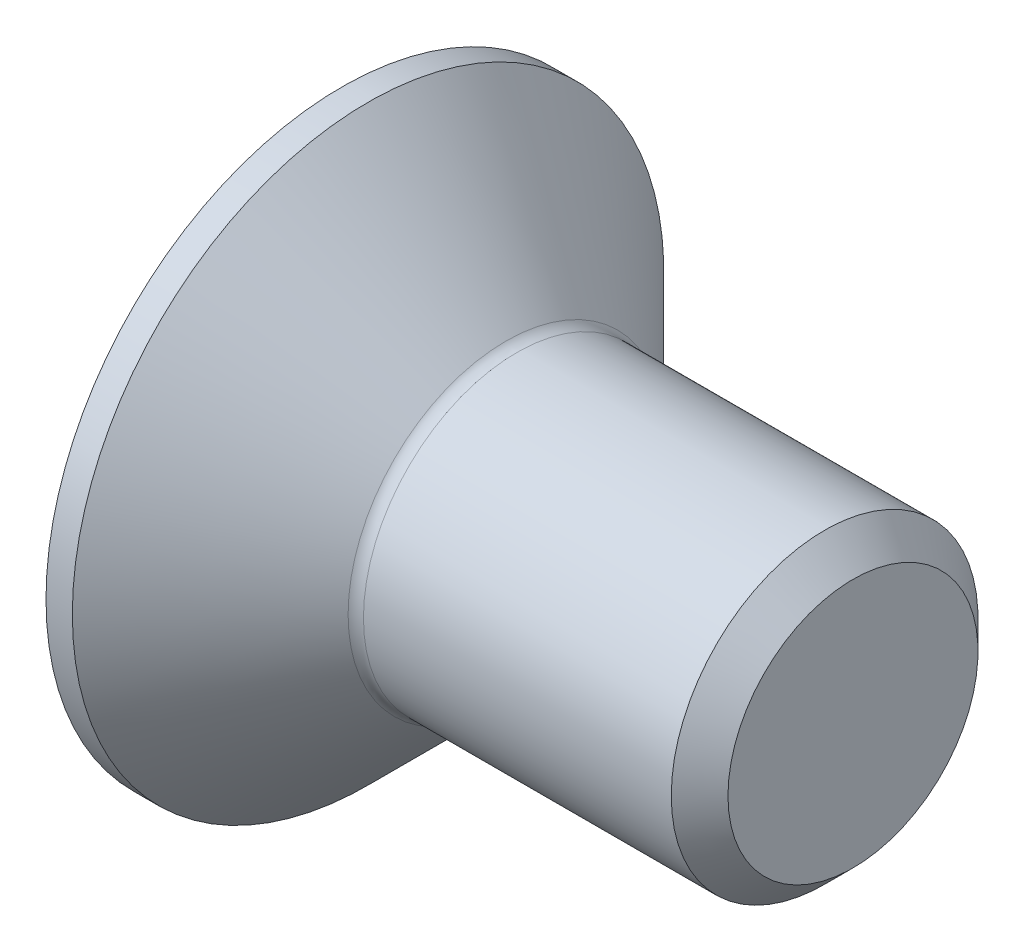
ISO-10303-21;
HEADER;
FILE_DESCRIPTION(('STEP AP214'),'2;1');
FILE_NAME('part.step','',(''),(''),'','','');
FILE_SCHEMA(('AUTOMOTIVE_DESIGN { 1 0 10303 214 1 1 1 1 }'));
ENDSEC;
DATA;
#1=APPLICATION_CONTEXT('core data for automotive mechanical design processes');
#2=APPLICATION_PROTOCOL_DEFINITION('international standard','automotive_design',2000,#1);
#3=PRODUCT_CONTEXT('',#1,'mechanical');
#4=PRODUCT('Part','Part','',(#3));
#5=PRODUCT_RELATED_PRODUCT_CATEGORY('part','',(#4));
#6=PRODUCT_DEFINITION_FORMATION('','',#4);
#7=PRODUCT_DEFINITION_CONTEXT('part definition',#1,'design');
#8=PRODUCT_DEFINITION('design','',#6,#7);
#9=PRODUCT_DEFINITION_SHAPE('','',#8);
#10=(LENGTH_UNIT() NAMED_UNIT(*) SI_UNIT(.MILLI.,.METRE.));
#11=(NAMED_UNIT(*) PLANE_ANGLE_UNIT() SI_UNIT($,.RADIAN.));
#12=(NAMED_UNIT(*) SI_UNIT($,.STERADIAN.) SOLID_ANGLE_UNIT());
#13=UNCERTAINTY_MEASURE_WITH_UNIT(LENGTH_MEASURE(1.E-05),#10,'distance_accuracy_value','');
#14=(GEOMETRIC_REPRESENTATION_CONTEXT(3) GLOBAL_UNCERTAINTY_ASSIGNED_CONTEXT((#13)) GLOBAL_UNIT_ASSIGNED_CONTEXT((#10,
#11,#12)) REPRESENTATION_CONTEXT('',''));
#15=CARTESIAN_POINT('',(0.,0.,0.));
#16=DIRECTION('',(0.,0.,1.));
#17=DIRECTION('',(1.,0.,0.));
#18=AXIS2_PLACEMENT_3D('',#15,#16,#17);
#19=CARTESIAN_POINT('',(0.,0.,0.));
#20=DIRECTION('',(-1.,0.,0.));
#21=DIRECTION('',(0.,0.,1.));
#22=AXIS2_PLACEMENT_3D('',#19,#20,#21);
#23=PLANE('',#22);
#24=CARTESIAN_POINT('',(0.,0.,0.));
#25=DIRECTION('',(-1.,0.,0.));
#26=DIRECTION('',(0.,0.,1.));
#27=AXIS2_PLACEMENT_3D('',#24,#25,#26);
#28=CIRCLE('',#27,5.785);
#29=CARTESIAN_POINT('',(0.,0.,5.785));
#30=VERTEX_POINT('',#29);
#31=EDGE_CURVE('E177',#30,#30,#28,.T.);
#32=ORIENTED_EDGE('',*,*,#31,.T.);
#33=EDGE_LOOP('',(#32));
#34=FACE_BOUND('',#33,.T.);
#35=DIRECTION('',(0.,-0.500000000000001,-0.866025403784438));
#36=VECTOR('',#35,1.);
#37=CARTESIAN_POINT('',(0.,-1.16047404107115,2.01));
#38=LINE('',#37,#36);
#39=CARTESIAN_POINT('',(0.,-1.16047404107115,2.01));
#40=VERTEX_POINT('',#39);
#41=CARTESIAN_POINT('',(0.,-2.3209480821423,0.));
#42=VERTEX_POINT('',#41);
#43=EDGE_CURVE('E131',#40,#42,#38,.T.);
#44=ORIENTED_EDGE('',*,*,#43,.T.);
#45=DIRECTION('',(0.,0.5,-0.866025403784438));
#46=VECTOR('',#45,1.);
#47=CARTESIAN_POINT('',(0.,-2.3209480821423,0.));
#48=LINE('',#47,#46);
#49=CARTESIAN_POINT('',(0.,-1.16047404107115,-2.01));
#50=VERTEX_POINT('',#49);
#51=EDGE_CURVE('E60',#42,#50,#48,.T.);
#52=ORIENTED_EDGE('',*,*,#51,.T.);
#53=DIRECTION('',(0.,1.,0.));
#54=VECTOR('',#53,1.);
#55=CARTESIAN_POINT('',(0.,-1.16047404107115,-2.01));
#56=LINE('',#55,#54);
#57=CARTESIAN_POINT('',(0.,1.16047404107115,-2.01));
#58=VERTEX_POINT('',#57);
#59=EDGE_CURVE('E147',#50,#58,#56,.T.);
#60=ORIENTED_EDGE('',*,*,#59,.T.);
#61=DIRECTION('',(0.,0.5,0.866025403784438));
#62=VECTOR('',#61,1.);
#63=CARTESIAN_POINT('',(0.,1.16047404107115,-2.01));
#64=LINE('',#63,#62);
#65=CARTESIAN_POINT('',(0.,2.3209480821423,0.));
#66=VERTEX_POINT('',#65);
#67=EDGE_CURVE('E305',#58,#66,#64,.T.);
#68=ORIENTED_EDGE('',*,*,#67,.T.);
#69=DIRECTION('',(0.,-0.5,0.866025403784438));
#70=VECTOR('',#69,1.);
#71=CARTESIAN_POINT('',(0.,2.3209480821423,0.));
#72=LINE('',#71,#70);
#73=CARTESIAN_POINT('',(0.,1.16047404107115,2.01));
#74=VERTEX_POINT('',#73);
#75=EDGE_CURVE('E309',#66,#74,#72,.T.);
#76=ORIENTED_EDGE('',*,*,#75,.T.);
#77=DIRECTION('',(0.,-1.,0.));
#78=VECTOR('',#77,1.);
#79=CARTESIAN_POINT('',(0.,1.16047404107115,2.01));
#80=LINE('',#79,#78);
#81=EDGE_CURVE('E313',#74,#40,#80,.T.);
#82=ORIENTED_EDGE('',*,*,#81,.T.);
#83=EDGE_LOOP('',(#44,#52,#60,#68,#76,#82));
#84=FACE_BOUND('',#83,.T.);
#85=ADVANCED_FACE('F44',(#34,#84),#23,.T.);
#86=CARTESIAN_POINT('',(0.,0.,0.));
#87=DIRECTION('',(-1.,0.,0.));
#88=DIRECTION('',(0.,0.,1.));
#89=AXIS2_PLACEMENT_3D('',#86,#87,#88);
#90=CYLINDRICAL_SURFACE('',#89,5.785);
#91=CARTESIAN_POINT('',(0.515000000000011,0.,0.));
#92=DIRECTION('',(-1.,0.,0.));
#93=DIRECTION('',(0.,0.,1.));
#94=AXIS2_PLACEMENT_3D('',#91,#92,#93);
#95=CIRCLE('',#94,5.785);
#96=CARTESIAN_POINT('',(0.515000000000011,0.,5.785));
#97=VERTEX_POINT('',#96);
#98=EDGE_CURVE('E173',#97,#97,#95,.T.);
#99=ORIENTED_EDGE('',*,*,#98,.T.);
#100=EDGE_LOOP('',(#99));
#101=FACE_BOUND('',#100,.T.);
#102=ORIENTED_EDGE('',*,*,#31,.F.);
#103=EDGE_LOOP('',(#102));
#104=FACE_BOUND('',#103,.T.);
#105=ADVANCED_FACE('F200',(#101,#104),#90,.T.);
#106=CARTESIAN_POINT('',(0.515000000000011,0.,0.));
#107=DIRECTION('',(-1.,0.,0.));
#108=DIRECTION('',(0.,0.,1.));
#109=AXIS2_PLACEMENT_3D('',#106,#107,#108);
#110=CONICAL_SURFACE('',#109,5.785,0.78539816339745);
#111=CARTESIAN_POINT('',(3.21213203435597,0.,0.));
#112=DIRECTION('',(-1.,0.,0.));
#113=DIRECTION('',(0.,0.,1.));
#114=AXIS2_PLACEMENT_3D('',#111,#112,#113);
#115=CIRCLE('',#114,3.08786796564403);
#116=CARTESIAN_POINT('',(3.21213203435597,0.,3.08786796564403));
#117=VERTEX_POINT('',#116);
#118=EDGE_CURVE('E53',#117,#117,#115,.T.);
#119=ORIENTED_EDGE('',*,*,#118,.T.);
#120=EDGE_LOOP('',(#119));
#121=FACE_BOUND('',#120,.T.);
#122=ORIENTED_EDGE('',*,*,#98,.F.);
#123=EDGE_LOOP('',(#122));
#124=FACE_BOUND('',#123,.T.);
#125=ADVANCED_FACE('F184',(#121,#124),#110,.T.);
#126=CARTESIAN_POINT('',(0.,0.,0.));
#127=DIRECTION('',(-1.,0.,0.));
#128=DIRECTION('',(0.,0.,1.));
#129=AXIS2_PLACEMENT_3D('',#126,#127,#128);
#130=CYLINDRICAL_SURFACE('',#129,2.99999999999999);
#131=CARTESIAN_POINT('',(3.42426406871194,0.,0.));
#132=DIRECTION('',(-1.,0.,0.));
#133=DIRECTION('',(0.,0.,1.));
#134=AXIS2_PLACEMENT_3D('',#131,#132,#133);
#135=CIRCLE('',#134,2.99999999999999);
#136=CARTESIAN_POINT('',(3.42426406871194,0.,2.99999999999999));
#137=VERTEX_POINT('',#136);
#138=EDGE_CURVE('E11',#137,#137,#135,.F.);
#139=ORIENTED_EDGE('',*,*,#138,.T.);
#140=EDGE_LOOP('',(#139));
#141=FACE_BOUND('',#140,.T.);
#142=CARTESIAN_POINT('',(9.44549999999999,0.,0.));
#143=DIRECTION('',(-1.,0.,0.));
#144=DIRECTION('',(0.,0.,1.));
#145=AXIS2_PLACEMENT_3D('',#142,#143,#144);
#146=CIRCLE('',#145,2.99999999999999);
#147=CARTESIAN_POINT('',(9.44549999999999,0.,2.99999999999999));
#148=VERTEX_POINT('',#147);
#149=EDGE_CURVE('E169',#148,#148,#146,.T.);
#150=ORIENTED_EDGE('',*,*,#149,.T.);
#151=EDGE_LOOP('',(#150));
#152=FACE_BOUND('',#151,.T.);
#153=ADVANCED_FACE('F211',(#141,#152),#130,.T.);
#154=CARTESIAN_POINT('',(10.,0.,0.));
#155=DIRECTION('',(-1.,0.,0.));
#156=DIRECTION('',(0.,0.,1.));
#157=AXIS2_PLACEMENT_3D('',#154,#155,#156);
#158=CONICAL_SURFACE('',#157,2.4455,0.785398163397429);
#159=ORIENTED_EDGE('',*,*,#149,.F.);
#160=EDGE_LOOP('',(#159));
#161=FACE_BOUND('',#160,.T.);
#162=CARTESIAN_POINT('',(10.,0.,0.));
#163=DIRECTION('',(-1.,0.,0.));
#164=DIRECTION('',(0.,0.,1.));
#165=AXIS2_PLACEMENT_3D('',#162,#163,#164);
#166=CIRCLE('',#165,2.4455);
#167=CARTESIAN_POINT('',(10.,0.,2.4455));
#168=VERTEX_POINT('',#167);
#169=EDGE_CURVE('E164',#168,#168,#166,.T.);
#170=ORIENTED_EDGE('',*,*,#169,.T.);
#171=EDGE_LOOP('',(#170));
#172=FACE_BOUND('',#171,.T.);
#173=ADVANCED_FACE('F195',(#161,#172),#158,.T.);
#174=CARTESIAN_POINT('',(10.,2.4455,0.));
#175=DIRECTION('',(1.,0.,0.));
#176=DIRECTION('',(0.,0.,-1.));
#177=AXIS2_PLACEMENT_3D('',#174,#175,#176);
#178=PLANE('',#177);
#179=ORIENTED_EDGE('',*,*,#169,.F.);
#180=EDGE_LOOP('',(#179));
#181=FACE_BOUND('',#180,.T.);
#182=ADVANCED_FACE('F188',(#181),#178,.T.);
#183=CARTESIAN_POINT('',(3.42426406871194,0.,0.));
#184=DIRECTION('',(-1.,0.,0.));
#185=DIRECTION('',(0.,0.,1.));
#186=AXIS2_PLACEMENT_3D('',#183,#184,#185);
#187=TOROIDAL_SURFACE('',#186,3.29999999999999,0.3);
#188=ORIENTED_EDGE('',*,*,#138,.F.);
#189=EDGE_LOOP('',(#188));
#190=FACE_BOUND('',#189,.T.);
#191=ORIENTED_EDGE('',*,*,#118,.F.);
#192=EDGE_LOOP('',(#191));
#193=FACE_BOUND('',#192,.T.);
#194=ADVANCED_FACE('F46',(#190,#193),#187,.F.);
#195=CARTESIAN_POINT('',(2.5,-2.3209480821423,0.));
#196=DIRECTION('',(0.,0.866025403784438,0.5));
#197=DIRECTION('',(0.,-0.5,0.866025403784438));
#198=AXIS2_PLACEMENT_3D('',#195,#196,#197);
#199=PLANE('',#198);
#200=ORIENTED_EDGE('',*,*,#51,.F.);
#201=DIRECTION('',(-1.,0.,0.));
#202=VECTOR('',#201,1.);
#203=CARTESIAN_POINT('',(2.5,-2.3209480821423,0.));
#204=LINE('',#203,#202);
#205=CARTESIAN_POINT('',(2.5,-2.3209480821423,0.));
#206=VERTEX_POINT('',#205);
#207=EDGE_CURVE('E300',#206,#42,#204,.T.);
#208=ORIENTED_EDGE('',*,*,#207,.F.);
#209=DIRECTION('',(0.,0.5,-0.866025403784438));
#210=VECTOR('',#209,1.);
#211=CARTESIAN_POINT('',(2.5,-2.3209480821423,0.));
#212=LINE('',#211,#210);
#213=CARTESIAN_POINT('',(2.5,-1.74071106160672,-1.005));
#214=VERTEX_POINT('',#213);
#215=EDGE_CURVE('E127',#206,#214,#212,.T.);
#216=ORIENTED_EDGE('',*,*,#215,.T.);
#217=CARTESIAN_POINT('',(2.5,-1.16047404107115,-2.01));
#218=VERTEX_POINT('',#217);
#219=EDGE_CURVE('E121',#214,#218,#212,.T.);
#220=ORIENTED_EDGE('',*,*,#219,.T.);
#221=DIRECTION('',(-1.,0.,0.));
#222=VECTOR('',#221,1.);
#223=CARTESIAN_POINT('',(2.5,-1.16047404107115,-2.01));
#224=LINE('',#223,#222);
#225=EDGE_CURVE('E125',#218,#50,#224,.T.);
#226=ORIENTED_EDGE('',*,*,#225,.T.);
#227=EDGE_LOOP('',(#200,#208,#216,#220,#226));
#228=FACE_BOUND('',#227,.T.);
#229=ADVANCED_FACE('F123',(#228),#199,.T.);
#230=CARTESIAN_POINT('',(2.5,-1.16047404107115,-2.01));
#231=DIRECTION('',(0.,0.,1.));
#232=DIRECTION('',(1.,0.,0.));
#233=AXIS2_PLACEMENT_3D('',#230,#231,#232);
#234=PLANE('',#233);
#235=ORIENTED_EDGE('',*,*,#59,.F.);
#236=ORIENTED_EDGE('',*,*,#225,.F.);
#237=DIRECTION('',(0.,1.,0.));
#238=VECTOR('',#237,1.);
#239=CARTESIAN_POINT('',(2.5,-1.16047404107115,-2.01));
#240=LINE('',#239,#238);
#241=CARTESIAN_POINT('',(2.5,0.,-2.01));
#242=VERTEX_POINT('',#241);
#243=EDGE_CURVE('E134',#218,#242,#240,.T.);
#244=ORIENTED_EDGE('',*,*,#243,.T.);
#245=CARTESIAN_POINT('',(2.5,1.16047404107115,-2.01));
#246=VERTEX_POINT('',#245);
#247=EDGE_CURVE('E142',#242,#246,#240,.T.);
#248=ORIENTED_EDGE('',*,*,#247,.T.);
#249=DIRECTION('',(-1.,0.,0.));
#250=VECTOR('',#249,1.);
#251=CARTESIAN_POINT('',(2.5,1.16047404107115,-2.01));
#252=LINE('',#251,#250);
#253=EDGE_CURVE('E150',#246,#58,#252,.T.);
#254=ORIENTED_EDGE('',*,*,#253,.T.);
#255=EDGE_LOOP('',(#235,#236,#244,#248,#254));
#256=FACE_BOUND('',#255,.T.);
#257=ADVANCED_FACE('F144',(#256),#234,.T.);
#258=CARTESIAN_POINT('',(2.5,1.16047404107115,-2.01));
#259=DIRECTION('',(0.,-0.866025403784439,0.5));
#260=DIRECTION('',(0.,-0.5,-0.866025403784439));
#261=AXIS2_PLACEMENT_3D('',#258,#259,#260);
#262=PLANE('',#261);
#263=ORIENTED_EDGE('',*,*,#67,.F.);
#264=ORIENTED_EDGE('',*,*,#253,.F.);
#265=DIRECTION('',(0.,0.5,0.866025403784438));
#266=VECTOR('',#265,1.);
#267=CARTESIAN_POINT('',(2.5,1.16047404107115,-2.01));
#268=LINE('',#267,#266);
#269=CARTESIAN_POINT('',(2.5,1.74071106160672,-1.005));
#270=VERTEX_POINT('',#269);
#271=EDGE_CURVE('E288',#246,#270,#268,.T.);
#272=ORIENTED_EDGE('',*,*,#271,.T.);
#273=CARTESIAN_POINT('',(2.5,2.3209480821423,0.));
#274=VERTEX_POINT('',#273);
#275=EDGE_CURVE('E141',#270,#274,#268,.T.);
#276=ORIENTED_EDGE('',*,*,#275,.T.);
#277=DIRECTION('',(-1.,0.,0.));
#278=VECTOR('',#277,1.);
#279=CARTESIAN_POINT('',(2.5,2.3209480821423,0.));
#280=LINE('',#279,#278);
#281=EDGE_CURVE('E158',#274,#66,#280,.T.);
#282=ORIENTED_EDGE('',*,*,#281,.T.);
#283=EDGE_LOOP('',(#263,#264,#272,#276,#282));
#284=FACE_BOUND('',#283,.T.);
#285=ADVANCED_FACE('F225',(#284),#262,.T.);
#286=CARTESIAN_POINT('',(2.5,2.3209480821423,0.));
#287=DIRECTION('',(0.,-0.866025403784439,-0.5));
#288=DIRECTION('',(0.,0.5,-0.866025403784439));
#289=AXIS2_PLACEMENT_3D('',#286,#287,#288);
#290=PLANE('',#289);
#291=ORIENTED_EDGE('',*,*,#75,.F.);
#292=ORIENTED_EDGE('',*,*,#281,.F.);
#293=DIRECTION('',(0.,-0.5,0.866025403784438));
#294=VECTOR('',#293,1.);
#295=CARTESIAN_POINT('',(2.5,2.3209480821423,0.));
#296=LINE('',#295,#294);
#297=CARTESIAN_POINT('',(2.5,1.74071106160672,1.005));
#298=VERTEX_POINT('',#297);
#299=EDGE_CURVE('E68',#274,#298,#296,.T.);
#300=ORIENTED_EDGE('',*,*,#299,.T.);
#301=CARTESIAN_POINT('',(2.5,1.16047404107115,2.01));
#302=VERTEX_POINT('',#301);
#303=EDGE_CURVE('E260',#298,#302,#296,.T.);
#304=ORIENTED_EDGE('',*,*,#303,.T.);
#305=DIRECTION('',(-1.,0.,0.));
#306=VECTOR('',#305,1.);
#307=CARTESIAN_POINT('',(2.5,1.16047404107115,2.01));
#308=LINE('',#307,#306);
#309=EDGE_CURVE('E275',#302,#74,#308,.T.);
#310=ORIENTED_EDGE('',*,*,#309,.T.);
#311=EDGE_LOOP('',(#291,#292,#300,#304,#310));
#312=FACE_BOUND('',#311,.T.);
#313=ADVANCED_FACE('F228',(#312),#290,.T.);
#314=CARTESIAN_POINT('',(2.5,1.16047404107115,2.01));
#315=DIRECTION('',(0.,0.,-1.));
#316=DIRECTION('',(0.,1.,0.));
#317=AXIS2_PLACEMENT_3D('',#314,#315,#316);
#318=PLANE('',#317);
#319=ORIENTED_EDGE('',*,*,#81,.F.);
#320=ORIENTED_EDGE('',*,*,#309,.F.);
#321=DIRECTION('',(0.,-1.,0.));
#322=VECTOR('',#321,1.);
#323=CARTESIAN_POINT('',(2.5,1.16047404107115,2.01));
#324=LINE('',#323,#322);
#325=CARTESIAN_POINT('',(2.5,0.,2.01));
#326=VERTEX_POINT('',#325);
#327=EDGE_CURVE('E259',#302,#326,#324,.T.);
#328=ORIENTED_EDGE('',*,*,#327,.T.);
#329=CARTESIAN_POINT('',(2.5,-1.16047404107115,2.01));
#330=VERTEX_POINT('',#329);
#331=EDGE_CURVE('E265',#326,#330,#324,.T.);
#332=ORIENTED_EDGE('',*,*,#331,.T.);
#333=DIRECTION('',(-1.,0.,0.));
#334=VECTOR('',#333,1.);
#335=CARTESIAN_POINT('',(2.5,-1.16047404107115,2.01));
#336=LINE('',#335,#334);
#337=EDGE_CURVE('E322',#330,#40,#336,.T.);
#338=ORIENTED_EDGE('',*,*,#337,.T.);
#339=EDGE_LOOP('',(#319,#320,#328,#332,#338));
#340=FACE_BOUND('',#339,.T.);
#341=ADVANCED_FACE('F232',(#340),#318,.T.);
#342=CARTESIAN_POINT('',(2.5,-1.16047404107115,2.01));
#343=DIRECTION('',(0.,0.866025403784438,-0.500000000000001));
#344=DIRECTION('',(0.,0.500000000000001,0.866025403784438));
#345=AXIS2_PLACEMENT_3D('',#342,#343,#344);
#346=PLANE('',#345);
#347=ORIENTED_EDGE('',*,*,#43,.F.);
#348=ORIENTED_EDGE('',*,*,#337,.F.);
#349=DIRECTION('',(0.,-0.500000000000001,-0.866025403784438));
#350=VECTOR('',#349,1.);
#351=CARTESIAN_POINT('',(2.5,-1.16047404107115,2.01));
#352=LINE('',#351,#350);
#353=CARTESIAN_POINT('',(2.5,-1.74071106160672,1.005));
#354=VERTEX_POINT('',#353);
#355=EDGE_CURVE('E268',#330,#354,#352,.T.);
#356=ORIENTED_EDGE('',*,*,#355,.T.);
#357=EDGE_CURVE('E277',#354,#206,#352,.T.);
#358=ORIENTED_EDGE('',*,*,#357,.T.);
#359=ORIENTED_EDGE('',*,*,#207,.T.);
#360=EDGE_LOOP('',(#347,#348,#356,#358,#359));
#361=FACE_BOUND('',#360,.T.);
#362=ADVANCED_FACE('F235',(#361),#346,.T.);
#363=CARTESIAN_POINT('',(2.5,-2.3209480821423,0.));
#364=DIRECTION('',(-1.,0.,0.));
#365=DIRECTION('',(0.,0.,1.));
#366=AXIS2_PLACEMENT_3D('',#363,#364,#365);
#367=PLANE('',#366);
#368=CARTESIAN_POINT('',(2.5,0.,0.));
#369=DIRECTION('',(-1.,0.,0.));
#370=DIRECTION('',(0.,0.,1.));
#371=AXIS2_PLACEMENT_3D('',#368,#369,#370);
#372=CIRCLE('',#371,2.01);
#373=EDGE_CURVE('E149',#354,#326,#372,.T.);
#374=ORIENTED_EDGE('',*,*,#373,.F.);
#375=ORIENTED_EDGE('',*,*,#355,.F.);
#376=ORIENTED_EDGE('',*,*,#331,.F.);
#377=EDGE_LOOP('',(#374,#375,#376));
#378=FACE_BOUND('',#377,.T.);
#379=ADVANCED_FACE('F239',(#378),#367,.T.);
#380=EDGE_CURVE('E155',#214,#354,#372,.T.);
#381=ORIENTED_EDGE('',*,*,#380,.F.);
#382=ORIENTED_EDGE('',*,*,#215,.F.);
#383=ORIENTED_EDGE('',*,*,#357,.F.);
#384=EDGE_LOOP('',(#381,#382,#383));
#385=FACE_BOUND('',#384,.T.);
#386=ADVANCED_FACE('F242',(#385),#367,.T.);
#387=EDGE_CURVE('E136',#242,#214,#372,.T.);
#388=ORIENTED_EDGE('',*,*,#387,.F.);
#389=ORIENTED_EDGE('',*,*,#243,.F.);
#390=ORIENTED_EDGE('',*,*,#219,.F.);
#391=EDGE_LOOP('',(#388,#389,#390));
#392=FACE_BOUND('',#391,.T.);
#393=ADVANCED_FACE('F135',(#392),#367,.T.);
#394=EDGE_CURVE('E281',#270,#242,#372,.T.);
#395=ORIENTED_EDGE('',*,*,#394,.F.);
#396=ORIENTED_EDGE('',*,*,#271,.F.);
#397=ORIENTED_EDGE('',*,*,#247,.F.);
#398=EDGE_LOOP('',(#395,#396,#397));
#399=FACE_BOUND('',#398,.T.);
#400=ADVANCED_FACE('F254',(#399),#367,.T.);
#401=EDGE_CURVE('E165',#298,#270,#372,.T.);
#402=ORIENTED_EDGE('',*,*,#401,.F.);
#403=ORIENTED_EDGE('',*,*,#299,.F.);
#404=ORIENTED_EDGE('',*,*,#275,.F.);
#405=EDGE_LOOP('',(#402,#403,#404));
#406=FACE_BOUND('',#405,.T.);
#407=ADVANCED_FACE('F249',(#406),#367,.T.);
#408=EDGE_CURVE('E157',#326,#298,#372,.T.);
#409=ORIENTED_EDGE('',*,*,#408,.F.);
#410=ORIENTED_EDGE('',*,*,#327,.F.);
#411=ORIENTED_EDGE('',*,*,#303,.F.);
#412=EDGE_LOOP('',(#409,#410,#411));
#413=FACE_BOUND('',#412,.T.);
#414=ADVANCED_FACE('F220',(#413),#367,.T.);
#415=CARTESIAN_POINT('',(2.5,0.,0.));
#416=DIRECTION('',(-1.,0.,0.));
#417=DIRECTION('',(0.,0.,1.));
#418=AXIS2_PLACEMENT_3D('',#415,#416,#417);
#419=CONICAL_SURFACE('',#418,2.01,1.04719755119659);
#420=CARTESIAN_POINT('',(3.66047404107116,0.,0.));
#421=VERTEX_POINT('',#420);
#422=VERTEX_LOOP('',#421);
#423=FACE_BOUND('',#422,.T.);
#424=ORIENTED_EDGE('',*,*,#408,.T.);
#425=ORIENTED_EDGE('',*,*,#401,.T.);
#426=ORIENTED_EDGE('',*,*,#394,.T.);
#427=ORIENTED_EDGE('',*,*,#387,.T.);
#428=ORIENTED_EDGE('',*,*,#380,.T.);
#429=ORIENTED_EDGE('',*,*,#373,.T.);
#430=EDGE_LOOP('',(#424,#425,#426,#427,#428,#429));
#431=FACE_BOUND('',#430,.T.);
#432=ADVANCED_FACE('F218',(#423,#431),#419,.F.);
#433=CLOSED_SHELL('',(#85,#105,#125,#153,#173,#182,#194,#229,#257,#285,#313,#341,#362,#379,#386,
#393,#400,#407,#414,#432));
#434=MANIFOLD_SOLID_BREP('B2',#433);
#435=ADVANCED_BREP_SHAPE_REPRESENTATION('',(#18,#434),#14);
#436=SHAPE_DEFINITION_REPRESENTATION(#9,#435);
ENDSEC;
END-ISO-10303-21;
